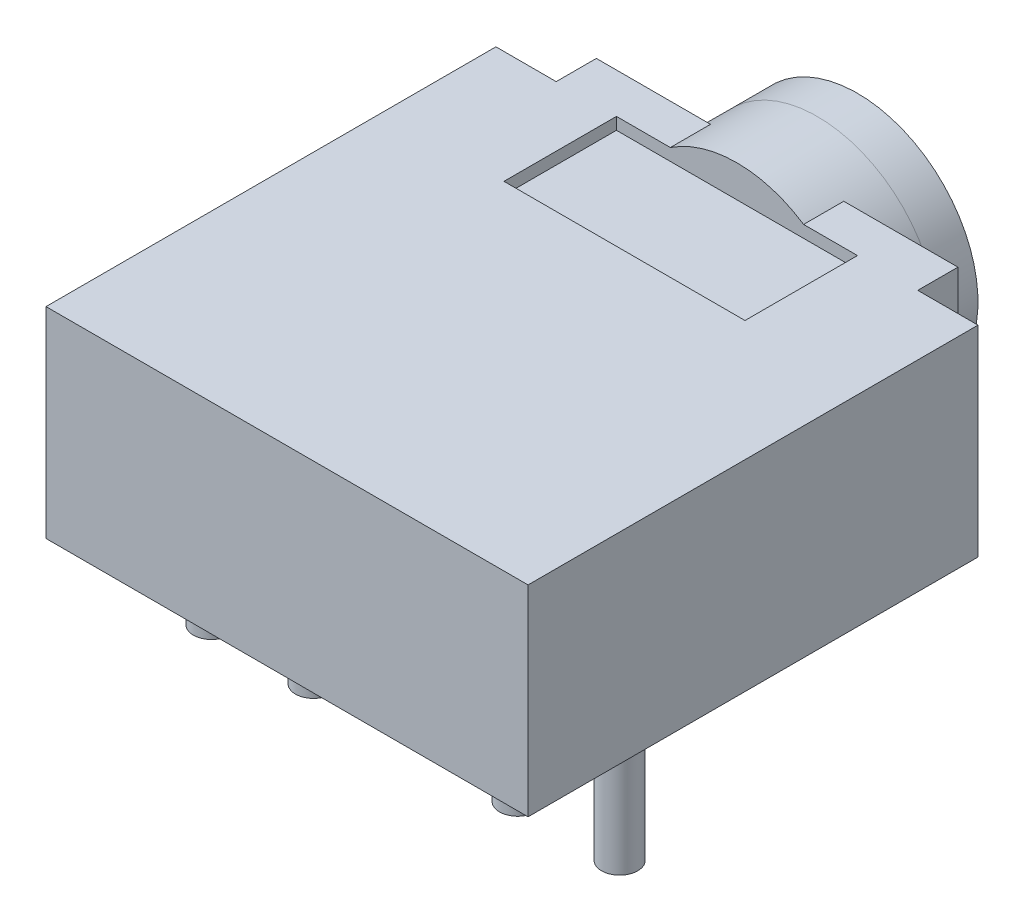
ISO-10303-21;
HEADER;
FILE_DESCRIPTION(('STEP AP214'),'2;1');
FILE_NAME('part.step','',(''),(''),'','','');
FILE_SCHEMA(('AUTOMOTIVE_DESIGN { 1 0 10303 214 1 1 1 1 }'));
ENDSEC;
DATA;
#1=APPLICATION_CONTEXT('core data for automotive mechanical design processes');
#2=APPLICATION_PROTOCOL_DEFINITION('international standard','automotive_design',2000,#1);
#3=PRODUCT_CONTEXT('',#1,'mechanical');
#4=PRODUCT('Part','Part','',(#3));
#5=PRODUCT_RELATED_PRODUCT_CATEGORY('part','',(#4));
#6=PRODUCT_DEFINITION_FORMATION('','',#4);
#7=PRODUCT_DEFINITION_CONTEXT('part definition',#1,'design');
#8=PRODUCT_DEFINITION('design','',#6,#7);
#9=PRODUCT_DEFINITION_SHAPE('','',#8);
#10=(LENGTH_UNIT() NAMED_UNIT(*) SI_UNIT(.MILLI.,.METRE.));
#11=(NAMED_UNIT(*) PLANE_ANGLE_UNIT() SI_UNIT($,.RADIAN.));
#12=(NAMED_UNIT(*) SI_UNIT($,.STERADIAN.) SOLID_ANGLE_UNIT());
#13=UNCERTAINTY_MEASURE_WITH_UNIT(LENGTH_MEASURE(1.E-05),#10,'distance_accuracy_value','');
#14=(GEOMETRIC_REPRESENTATION_CONTEXT(3) GLOBAL_UNCERTAINTY_ASSIGNED_CONTEXT((#13)) GLOBAL_UNIT_ASSIGNED_CONTEXT((#10,
#11,#12)) REPRESENTATION_CONTEXT('',''));
#15=CARTESIAN_POINT('',(0.,0.,0.));
#16=DIRECTION('',(0.,0.,1.));
#17=DIRECTION('',(1.,0.,0.));
#18=AXIS2_PLACEMENT_3D('',#15,#16,#17);
#19=CARTESIAN_POINT('',(-4.5,0.,-11.2));
#20=DIRECTION('',(0.,-1.,0.));
#21=DIRECTION('',(0.,0.,-1.));
#22=AXIS2_PLACEMENT_3D('',#19,#20,#21);
#23=PLANE('',#22);
#24=CARTESIAN_POINT('',(5.08,0.,-3.2));
#25=DIRECTION('',(0.,-1.,0.));
#26=DIRECTION('',(0.,0.,1.));
#27=AXIS2_PLACEMENT_3D('',#24,#25,#26);
#28=CIRCLE('',#27,0.45);
#29=CARTESIAN_POINT('',(5.08,0.,-2.75));
#30=VERTEX_POINT('',#29);
#31=EDGE_CURVE('E644',#30,#30,#28,.T.);
#32=ORIENTED_EDGE('',*,*,#31,.F.);
#33=EDGE_LOOP('',(#32));
#34=FACE_BOUND('',#33,.T.);
#35=CARTESIAN_POINT('',(-2.54,0.,-3.2));
#36=DIRECTION('',(0.,-1.,0.));
#37=DIRECTION('',(0.,0.,-1.));
#38=AXIS2_PLACEMENT_3D('',#35,#36,#37);
#39=CIRCLE('',#38,0.45);
#40=CARTESIAN_POINT('',(-2.54,0.,-3.65));
#41=VERTEX_POINT('',#40);
#42=EDGE_CURVE('E659',#41,#41,#39,.T.);
#43=ORIENTED_EDGE('',*,*,#42,.F.);
#44=EDGE_LOOP('',(#43));
#45=FACE_BOUND('',#44,.T.);
#46=DIRECTION('',(1.,0.,0.));
#47=VECTOR('',#46,1.);
#48=CARTESIAN_POINT('',(-4.5,0.,-11.2));
#49=LINE('',#48,#47);
#50=CARTESIAN_POINT('',(-1.6583123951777,0.,-11.2));
#51=VERTEX_POINT('',#50);
#52=CARTESIAN_POINT('',(1.6583123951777,0.,-11.2));
#53=VERTEX_POINT('',#52);
#54=EDGE_CURVE('E256',#51,#53,#49,.T.);
#55=ORIENTED_EDGE('',*,*,#54,.T.);
#56=DIRECTION('',(0.,0.,1.));
#57=VECTOR('',#56,1.);
#58=CARTESIAN_POINT('',(1.6583123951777,0.,-13.2));
#59=LINE('',#58,#57);
#60=CARTESIAN_POINT('',(1.6583123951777,0.,-12.2));
#61=VERTEX_POINT('',#60);
#62=EDGE_CURVE('E164',#53,#61,#59,.F.);
#63=ORIENTED_EDGE('',*,*,#62,.T.);
#64=DIRECTION('',(-1.,0.,0.));
#65=VECTOR('',#64,1.);
#66=CARTESIAN_POINT('',(4.5,0.,-12.2));
#67=LINE('',#66,#65);
#68=CARTESIAN_POINT('',(4.5,0.,-12.2));
#69=VERTEX_POINT('',#68);
#70=EDGE_CURVE('E199',#69,#61,#67,.T.);
#71=ORIENTED_EDGE('',*,*,#70,.F.);
#72=DIRECTION('',(0.,0.,-1.));
#73=VECTOR('',#72,1.);
#74=CARTESIAN_POINT('',(4.5,0.,-12.2));
#75=LINE('',#74,#73);
#76=CARTESIAN_POINT('',(4.5,0.,-11.2));
#77=VERTEX_POINT('',#76);
#78=EDGE_CURVE('E228',#77,#69,#75,.T.);
#79=ORIENTED_EDGE('',*,*,#78,.F.);
#80=DIRECTION('',(-1.,0.,0.));
#81=VECTOR('',#80,1.);
#82=CARTESIAN_POINT('',(4.5,0.,-11.2));
#83=LINE('',#82,#81);
#84=CARTESIAN_POINT('',(6.,0.,-11.2));
#85=VERTEX_POINT('',#84);
#86=EDGE_CURVE('E226',#85,#77,#83,.T.);
#87=ORIENTED_EDGE('',*,*,#86,.F.);
#88=DIRECTION('',(0.,0.,-1.));
#89=VECTOR('',#88,1.);
#90=CARTESIAN_POINT('',(6.,0.,-11.2));
#91=LINE('',#90,#89);
#92=CARTESIAN_POINT('',(6.,0.,0.));
#93=VERTEX_POINT('',#92);
#94=EDGE_CURVE('E224',#93,#85,#91,.T.);
#95=ORIENTED_EDGE('',*,*,#94,.F.);
#96=DIRECTION('',(1.,0.,0.));
#97=VECTOR('',#96,1.);
#98=CARTESIAN_POINT('',(-6.,0.,0.));
#99=LINE('',#98,#97);
#100=CARTESIAN_POINT('',(-6.,0.,0.));
#101=VERTEX_POINT('',#100);
#102=EDGE_CURVE('E222',#101,#93,#99,.T.);
#103=ORIENTED_EDGE('',*,*,#102,.F.);
#104=DIRECTION('',(0.,0.,1.));
#105=VECTOR('',#104,1.);
#106=CARTESIAN_POINT('',(-6.,0.,-11.2));
#107=LINE('',#106,#105);
#108=CARTESIAN_POINT('',(-6.,0.,-11.2));
#109=VERTEX_POINT('',#108);
#110=EDGE_CURVE('E220',#109,#101,#107,.T.);
#111=ORIENTED_EDGE('',*,*,#110,.F.);
#112=DIRECTION('',(-1.,0.,0.));
#113=VECTOR('',#112,1.);
#114=CARTESIAN_POINT('',(-4.5,0.,-11.2));
#115=LINE('',#114,#113);
#116=CARTESIAN_POINT('',(-4.5,0.,-11.2));
#117=VERTEX_POINT('',#116);
#118=EDGE_CURVE('E218',#117,#109,#115,.T.);
#119=ORIENTED_EDGE('',*,*,#118,.F.);
#120=DIRECTION('',(0.,0.,1.));
#121=VECTOR('',#120,1.);
#122=CARTESIAN_POINT('',(-4.5,0.,-12.2));
#123=LINE('',#122,#121);
#124=CARTESIAN_POINT('',(-4.5,0.,-12.2));
#125=VERTEX_POINT('',#124);
#126=EDGE_CURVE('E187',#125,#117,#123,.T.);
#127=ORIENTED_EDGE('',*,*,#126,.F.);
#128=CARTESIAN_POINT('',(-1.6583123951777,0.,-12.2));
#129=VERTEX_POINT('',#128);
#130=EDGE_CURVE('E230',#129,#125,#67,.T.);
#131=ORIENTED_EDGE('',*,*,#130,.F.);
#132=DIRECTION('',(0.,0.,1.));
#133=VECTOR('',#132,1.);
#134=CARTESIAN_POINT('',(-1.6583123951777,0.,-13.2));
#135=LINE('',#134,#133);
#136=EDGE_CURVE('E258',#129,#51,#135,.T.);
#137=ORIENTED_EDGE('',*,*,#136,.T.);
#138=EDGE_LOOP('',(#55,#63,#71,#79,#87,#95,#103,#111,#119,#127,#131,#137));
#139=FACE_BOUND('',#138,.T.);
#140=CARTESIAN_POINT('',(-5.08,0.,-3.2));
#141=DIRECTION('',(0.,-1.,0.));
#142=DIRECTION('',(0.,0.,-1.));
#143=AXIS2_PLACEMENT_3D('',#140,#141,#142);
#144=CIRCLE('',#143,0.45);
#145=CARTESIAN_POINT('',(-5.08,0.,-3.65));
#146=VERTEX_POINT('',#145);
#147=EDGE_CURVE('E665',#146,#146,#144,.T.);
#148=ORIENTED_EDGE('',*,*,#147,.F.);
#149=EDGE_LOOP('',(#148));
#150=FACE_BOUND('',#149,.T.);
#151=CARTESIAN_POINT('',(0.,0.,-8.39));
#152=DIRECTION('',(0.,-1.,0.));
#153=DIRECTION('',(0.,0.,-1.));
#154=AXIS2_PLACEMENT_3D('',#151,#152,#153);
#155=CIRCLE('',#154,0.450000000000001);
#156=CARTESIAN_POINT('',(0.,0.,-8.84));
#157=VERTEX_POINT('',#156);
#158=EDGE_CURVE('E654',#157,#157,#155,.T.);
#159=ORIENTED_EDGE('',*,*,#158,.F.);
#160=EDGE_LOOP('',(#159));
#161=FACE_BOUND('',#160,.T.);
#162=CARTESIAN_POINT('',(2.54,0.,-3.2));
#163=DIRECTION('',(0.,-1.,0.));
#164=DIRECTION('',(0.,0.,1.));
#165=AXIS2_PLACEMENT_3D('',#162,#163,#164);
#166=CIRCLE('',#165,0.45);
#167=CARTESIAN_POINT('',(2.54,0.,-2.75));
#168=VERTEX_POINT('',#167);
#169=EDGE_CURVE('E645',#168,#168,#166,.T.);
#170=ORIENTED_EDGE('',*,*,#169,.F.);
#171=EDGE_LOOP('',(#170));
#172=FACE_BOUND('',#171,.T.);
#173=ADVANCED_FACE('F37',(#34,#45,#139,#150,#161,#172),#23,.T.);
#174=CARTESIAN_POINT('',(4.5,5.,-12.2));
#175=DIRECTION('',(0.,0.,1.));
#176=DIRECTION('',(1.,0.,0.));
#177=AXIS2_PLACEMENT_3D('',#174,#175,#176);
#178=PLANE('',#177);
#179=CARTESIAN_POINT('',(0.,2.5,-12.2));
#180=DIRECTION('',(0.,0.,1.));
#181=DIRECTION('',(1.,0.,0.));
#182=AXIS2_PLACEMENT_3D('',#179,#180,#181);
#183=CIRCLE('',#182,3.);
#184=CARTESIAN_POINT('',(-1.6583123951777,5.,-12.2));
#185=VERTEX_POINT('',#184);
#186=EDGE_CURVE('E160',#129,#185,#183,.F.);
#187=ORIENTED_EDGE('',*,*,#186,.F.);
#188=ORIENTED_EDGE('',*,*,#130,.T.);
#189=DIRECTION('',(0.,-1.,0.));
#190=VECTOR('',#189,1.);
#191=CARTESIAN_POINT('',(-4.5,5.,-12.2));
#192=LINE('',#191,#190);
#193=CARTESIAN_POINT('',(-4.5,5.,-12.2));
#194=VERTEX_POINT('',#193);
#195=EDGE_CURVE('E215',#194,#125,#192,.T.);
#196=ORIENTED_EDGE('',*,*,#195,.F.);
#197=DIRECTION('',(-1.,0.,0.));
#198=VECTOR('',#197,1.);
#199=CARTESIAN_POINT('',(4.5,5.,-12.2));
#200=LINE('',#199,#198);
#201=EDGE_CURVE('E211',#185,#194,#200,.T.);
#202=ORIENTED_EDGE('',*,*,#201,.F.);
#203=EDGE_LOOP('',(#187,#188,#196,#202));
#204=FACE_BOUND('',#203,.T.);
#205=ADVANCED_FACE('F307',(#204),#178,.F.);
#206=CARTESIAN_POINT('',(1.6583123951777,5.,-12.2));
#207=VERTEX_POINT('',#206);
#208=EDGE_CURVE('E266',#207,#61,#183,.F.);
#209=ORIENTED_EDGE('',*,*,#208,.F.);
#210=CARTESIAN_POINT('',(4.5,5.,-12.2));
#211=VERTEX_POINT('',#210);
#212=EDGE_CURVE('E212',#211,#207,#200,.T.);
#213=ORIENTED_EDGE('',*,*,#212,.F.);
#214=DIRECTION('',(0.,-1.,0.));
#215=VECTOR('',#214,1.);
#216=CARTESIAN_POINT('',(4.5,5.,-12.2));
#217=LINE('',#216,#215);
#218=EDGE_CURVE('E235',#211,#69,#217,.T.);
#219=ORIENTED_EDGE('',*,*,#218,.T.);
#220=ORIENTED_EDGE('',*,*,#70,.T.);
#221=EDGE_LOOP('',(#209,#213,#219,#220));
#222=FACE_BOUND('',#221,.T.);
#223=ADVANCED_FACE('F313',(#222),#178,.F.);
#224=CARTESIAN_POINT('',(-4.5,5.,-11.2));
#225=DIRECTION('',(0.,-1.,0.));
#226=DIRECTION('',(0.,0.,-1.));
#227=AXIS2_PLACEMENT_3D('',#224,#225,#226);
#228=PLANE('',#227);
#229=DIRECTION('',(0.,0.,1.));
#230=VECTOR('',#229,1.);
#231=CARTESIAN_POINT('',(1.6583123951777,5.,-13.2));
#232=LINE('',#231,#230);
#233=CARTESIAN_POINT('',(1.6583123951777,5.,-11.2));
#234=VERTEX_POINT('',#233);
#235=EDGE_CURVE('E269',#234,#207,#232,.F.);
#236=ORIENTED_EDGE('',*,*,#235,.F.);
#237=DIRECTION('',(-1.,0.,0.));
#238=VECTOR('',#237,1.);
#239=CARTESIAN_POINT('',(-3.,5.,-11.2));
#240=LINE('',#239,#238);
#241=CARTESIAN_POINT('',(3.,5.,-11.2));
#242=VERTEX_POINT('',#241);
#243=EDGE_CURVE('E172',#242,#234,#240,.T.);
#244=ORIENTED_EDGE('',*,*,#243,.F.);
#245=DIRECTION('',(0.,0.,-1.));
#246=VECTOR('',#245,1.);
#247=CARTESIAN_POINT('',(3.,5.,-11.2));
#248=LINE('',#247,#246);
#249=CARTESIAN_POINT('',(3.,5.,-8.4));
#250=VERTEX_POINT('',#249);
#251=EDGE_CURVE('E177',#250,#242,#248,.T.);
#252=ORIENTED_EDGE('',*,*,#251,.F.);
#253=DIRECTION('',(1.,0.,0.));
#254=VECTOR('',#253,1.);
#255=CARTESIAN_POINT('',(-3.,5.,-8.4));
#256=LINE('',#255,#254);
#257=CARTESIAN_POINT('',(-3.,5.,-8.4));
#258=VERTEX_POINT('',#257);
#259=EDGE_CURVE('E181',#258,#250,#256,.T.);
#260=ORIENTED_EDGE('',*,*,#259,.F.);
#261=DIRECTION('',(0.,0.,1.));
#262=VECTOR('',#261,1.);
#263=CARTESIAN_POINT('',(-3.,5.,-11.2));
#264=LINE('',#263,#262);
#265=CARTESIAN_POINT('',(-3.,5.,-11.2));
#266=VERTEX_POINT('',#265);
#267=EDGE_CURVE('E63',#266,#258,#264,.T.);
#268=ORIENTED_EDGE('',*,*,#267,.F.);
#269=CARTESIAN_POINT('',(-1.6583123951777,5.,-11.2));
#270=VERTEX_POINT('',#269);
#271=EDGE_CURVE('E170',#270,#266,#240,.T.);
#272=ORIENTED_EDGE('',*,*,#271,.F.);
#273=DIRECTION('',(0.,0.,1.));
#274=VECTOR('',#273,1.);
#275=CARTESIAN_POINT('',(-1.6583123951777,5.,-13.2));
#276=LINE('',#275,#274);
#277=EDGE_CURVE('E154',#185,#270,#276,.T.);
#278=ORIENTED_EDGE('',*,*,#277,.F.);
#279=ORIENTED_EDGE('',*,*,#201,.T.);
#280=DIRECTION('',(0.,0.,1.));
#281=VECTOR('',#280,1.);
#282=CARTESIAN_POINT('',(-4.5,5.,-12.2));
#283=LINE('',#282,#281);
#284=CARTESIAN_POINT('',(-4.5,5.,-11.2));
#285=VERTEX_POINT('',#284);
#286=EDGE_CURVE('E195',#194,#285,#283,.T.);
#287=ORIENTED_EDGE('',*,*,#286,.T.);
#288=DIRECTION('',(-1.,0.,0.));
#289=VECTOR('',#288,1.);
#290=CARTESIAN_POINT('',(-4.5,5.,-11.2));
#291=LINE('',#290,#289);
#292=CARTESIAN_POINT('',(-6.,5.,-11.2));
#293=VERTEX_POINT('',#292);
#294=EDGE_CURVE('E198',#285,#293,#291,.T.);
#295=ORIENTED_EDGE('',*,*,#294,.T.);
#296=DIRECTION('',(0.,0.,1.));
#297=VECTOR('',#296,1.);
#298=CARTESIAN_POINT('',(-6.,5.,-11.2));
#299=LINE('',#298,#297);
#300=CARTESIAN_POINT('',(-6.,5.,0.));
#301=VERTEX_POINT('',#300);
#302=EDGE_CURVE('E201',#293,#301,#299,.T.);
#303=ORIENTED_EDGE('',*,*,#302,.T.);
#304=DIRECTION('',(1.,0.,0.));
#305=VECTOR('',#304,1.);
#306=CARTESIAN_POINT('',(-6.,5.,0.));
#307=LINE('',#306,#305);
#308=CARTESIAN_POINT('',(6.,5.,0.));
#309=VERTEX_POINT('',#308);
#310=EDGE_CURVE('E203',#301,#309,#307,.T.);
#311=ORIENTED_EDGE('',*,*,#310,.T.);
#312=DIRECTION('',(0.,0.,-1.));
#313=VECTOR('',#312,1.);
#314=CARTESIAN_POINT('',(6.,5.,-11.2));
#315=LINE('',#314,#313);
#316=CARTESIAN_POINT('',(6.,5.,-11.2));
#317=VERTEX_POINT('',#316);
#318=EDGE_CURVE('E205',#309,#317,#315,.T.);
#319=ORIENTED_EDGE('',*,*,#318,.T.);
#320=DIRECTION('',(-1.,0.,0.));
#321=VECTOR('',#320,1.);
#322=CARTESIAN_POINT('',(4.5,5.,-11.2));
#323=LINE('',#322,#321);
#324=CARTESIAN_POINT('',(4.5,5.,-11.2));
#325=VERTEX_POINT('',#324);
#326=EDGE_CURVE('E207',#317,#325,#323,.T.);
#327=ORIENTED_EDGE('',*,*,#326,.T.);
#328=DIRECTION('',(0.,0.,-1.));
#329=VECTOR('',#328,1.);
#330=CARTESIAN_POINT('',(4.5,5.,-12.2));
#331=LINE('',#330,#329);
#332=EDGE_CURVE('E209',#325,#211,#331,.T.);
#333=ORIENTED_EDGE('',*,*,#332,.T.);
#334=ORIENTED_EDGE('',*,*,#212,.T.);
#335=EDGE_LOOP('',(#236,#244,#252,#260,#268,#272,#278,#279,#287,#295,#303,#311,#319,#327,#333,#334));
#336=FACE_BOUND('',#335,.T.);
#337=ADVANCED_FACE('F175',(#336),#228,.F.);
#338=CARTESIAN_POINT('',(-4.5,5.,-12.2));
#339=DIRECTION('',(1.,0.,0.));
#340=DIRECTION('',(0.,0.,-1.));
#341=AXIS2_PLACEMENT_3D('',#338,#339,#340);
#342=PLANE('',#341);
#343=ORIENTED_EDGE('',*,*,#126,.T.);
#344=DIRECTION('',(0.,-1.,0.));
#345=VECTOR('',#344,1.);
#346=CARTESIAN_POINT('',(-4.5,5.,-11.2));
#347=LINE('',#346,#345);
#348=EDGE_CURVE('E11',#285,#117,#347,.T.);
#349=ORIENTED_EDGE('',*,*,#348,.F.);
#350=ORIENTED_EDGE('',*,*,#286,.F.);
#351=ORIENTED_EDGE('',*,*,#195,.T.);
#352=EDGE_LOOP('',(#343,#349,#350,#351));
#353=FACE_BOUND('',#352,.T.);
#354=ADVANCED_FACE('F39',(#353),#342,.F.);
#355=CARTESIAN_POINT('',(-4.5,5.,-11.2));
#356=DIRECTION('',(0.,0.,1.));
#357=DIRECTION('',(1.,0.,0.));
#358=AXIS2_PLACEMENT_3D('',#355,#356,#357);
#359=PLANE('',#358);
#360=ORIENTED_EDGE('',*,*,#118,.T.);
#361=DIRECTION('',(0.,-1.,0.));
#362=VECTOR('',#361,1.);
#363=CARTESIAN_POINT('',(-6.,5.,-11.2));
#364=LINE('',#363,#362);
#365=EDGE_CURVE('E48',#293,#109,#364,.T.);
#366=ORIENTED_EDGE('',*,*,#365,.F.);
#367=ORIENTED_EDGE('',*,*,#294,.F.);
#368=ORIENTED_EDGE('',*,*,#348,.T.);
#369=EDGE_LOOP('',(#360,#366,#367,#368));
#370=FACE_BOUND('',#369,.T.);
#371=ADVANCED_FACE('F332',(#370),#359,.F.);
#372=CARTESIAN_POINT('',(-6.,5.,-11.2));
#373=DIRECTION('',(1.,0.,0.));
#374=DIRECTION('',(0.,0.,-1.));
#375=AXIS2_PLACEMENT_3D('',#372,#373,#374);
#376=PLANE('',#375);
#377=ORIENTED_EDGE('',*,*,#110,.T.);
#378=DIRECTION('',(0.,-1.,0.));
#379=VECTOR('',#378,1.);
#380=CARTESIAN_POINT('',(-6.,5.,0.));
#381=LINE('',#380,#379);
#382=EDGE_CURVE('E247',#301,#101,#381,.T.);
#383=ORIENTED_EDGE('',*,*,#382,.F.);
#384=ORIENTED_EDGE('',*,*,#302,.F.);
#385=ORIENTED_EDGE('',*,*,#365,.T.);
#386=EDGE_LOOP('',(#377,#383,#384,#385));
#387=FACE_BOUND('',#386,.T.);
#388=ADVANCED_FACE('F329',(#387),#376,.F.);
#389=CARTESIAN_POINT('',(-6.,5.,0.));
#390=DIRECTION('',(0.,0.,-1.));
#391=DIRECTION('',(-1.,0.,0.));
#392=AXIS2_PLACEMENT_3D('',#389,#390,#391);
#393=PLANE('',#392);
#394=ORIENTED_EDGE('',*,*,#102,.T.);
#395=DIRECTION('',(0.,-1.,0.));
#396=VECTOR('',#395,1.);
#397=CARTESIAN_POINT('',(6.,5.,0.));
#398=LINE('',#397,#396);
#399=EDGE_CURVE('E244',#309,#93,#398,.T.);
#400=ORIENTED_EDGE('',*,*,#399,.F.);
#401=ORIENTED_EDGE('',*,*,#310,.F.);
#402=ORIENTED_EDGE('',*,*,#382,.T.);
#403=EDGE_LOOP('',(#394,#400,#401,#402));
#404=FACE_BOUND('',#403,.T.);
#405=ADVANCED_FACE('F325',(#404),#393,.F.);
#406=CARTESIAN_POINT('',(6.,5.,-11.2));
#407=DIRECTION('',(-1.,0.,0.));
#408=DIRECTION('',(0.,0.,1.));
#409=AXIS2_PLACEMENT_3D('',#406,#407,#408);
#410=PLANE('',#409);
#411=ORIENTED_EDGE('',*,*,#94,.T.);
#412=DIRECTION('',(0.,-1.,0.));
#413=VECTOR('',#412,1.);
#414=CARTESIAN_POINT('',(6.,5.,-11.2));
#415=LINE('',#414,#413);
#416=EDGE_CURVE('E241',#317,#85,#415,.T.);
#417=ORIENTED_EDGE('',*,*,#416,.F.);
#418=ORIENTED_EDGE('',*,*,#318,.F.);
#419=ORIENTED_EDGE('',*,*,#399,.T.);
#420=EDGE_LOOP('',(#411,#417,#418,#419));
#421=FACE_BOUND('',#420,.T.);
#422=ADVANCED_FACE('F321',(#421),#410,.F.);
#423=CARTESIAN_POINT('',(4.5,5.,-11.2));
#424=DIRECTION('',(0.,0.,1.));
#425=DIRECTION('',(1.,0.,0.));
#426=AXIS2_PLACEMENT_3D('',#423,#424,#425);
#427=PLANE('',#426);
#428=ORIENTED_EDGE('',*,*,#86,.T.);
#429=DIRECTION('',(0.,-1.,0.));
#430=VECTOR('',#429,1.);
#431=CARTESIAN_POINT('',(4.5,5.,-11.2));
#432=LINE('',#431,#430);
#433=EDGE_CURVE('E238',#325,#77,#432,.T.);
#434=ORIENTED_EDGE('',*,*,#433,.F.);
#435=ORIENTED_EDGE('',*,*,#326,.F.);
#436=ORIENTED_EDGE('',*,*,#416,.T.);
#437=EDGE_LOOP('',(#428,#434,#435,#436));
#438=FACE_BOUND('',#437,.T.);
#439=ADVANCED_FACE('F301',(#438),#427,.F.);
#440=CARTESIAN_POINT('',(4.5,5.,-12.2));
#441=DIRECTION('',(-1.,0.,0.));
#442=DIRECTION('',(0.,0.,1.));
#443=AXIS2_PLACEMENT_3D('',#440,#441,#442);
#444=PLANE('',#443);
#445=ORIENTED_EDGE('',*,*,#78,.T.);
#446=ORIENTED_EDGE('',*,*,#218,.F.);
#447=ORIENTED_EDGE('',*,*,#332,.F.);
#448=ORIENTED_EDGE('',*,*,#433,.T.);
#449=EDGE_LOOP('',(#445,#446,#447,#448));
#450=FACE_BOUND('',#449,.T.);
#451=ADVANCED_FACE('F294',(#450),#444,.F.);
#452=CARTESIAN_POINT('',(-3.,4.7,-11.2));
#453=DIRECTION('',(-1.,0.,0.));
#454=DIRECTION('',(0.,0.,1.));
#455=AXIS2_PLACEMENT_3D('',#452,#453,#454);
#456=PLANE('',#455);
#457=ORIENTED_EDGE('',*,*,#267,.T.);
#458=DIRECTION('',(0.,1.,0.));
#459=VECTOR('',#458,1.);
#460=CARTESIAN_POINT('',(-3.,4.7,-8.4));
#461=LINE('',#460,#459);
#462=CARTESIAN_POINT('',(-3.,4.7,-8.4));
#463=VERTEX_POINT('',#462);
#464=EDGE_CURVE('E192',#463,#258,#461,.T.);
#465=ORIENTED_EDGE('',*,*,#464,.F.);
#466=DIRECTION('',(0.,0.,1.));
#467=VECTOR('',#466,1.);
#468=CARTESIAN_POINT('',(-3.,4.7,-11.2));
#469=LINE('',#468,#467);
#470=CARTESIAN_POINT('',(-3.,4.7,-11.2));
#471=VERTEX_POINT('',#470);
#472=EDGE_CURVE('E179',#471,#463,#469,.T.);
#473=ORIENTED_EDGE('',*,*,#472,.F.);
#474=DIRECTION('',(0.,1.,0.));
#475=VECTOR('',#474,1.);
#476=CARTESIAN_POINT('',(-3.,4.7,-11.2));
#477=LINE('',#476,#475);
#478=EDGE_CURVE('E185',#471,#266,#477,.T.);
#479=ORIENTED_EDGE('',*,*,#478,.T.);
#480=EDGE_LOOP('',(#457,#465,#473,#479));
#481=FACE_BOUND('',#480,.T.);
#482=ADVANCED_FACE('F292',(#481),#456,.F.);
#483=CARTESIAN_POINT('',(-3.,4.7,-11.2));
#484=DIRECTION('',(0.,0.,-1.));
#485=DIRECTION('',(-1.,0.,0.));
#486=AXIS2_PLACEMENT_3D('',#483,#484,#485);
#487=PLANE('',#486);
#488=ORIENTED_EDGE('',*,*,#478,.F.);
#489=DIRECTION('',(-1.,0.,0.));
#490=VECTOR('',#489,1.);
#491=CARTESIAN_POINT('',(-3.,4.7,-11.2));
#492=LINE('',#491,#490);
#493=CARTESIAN_POINT('',(3.,4.7,-11.2));
#494=VERTEX_POINT('',#493);
#495=EDGE_CURVE('E194',#494,#471,#492,.T.);
#496=ORIENTED_EDGE('',*,*,#495,.F.);
#497=DIRECTION('',(0.,1.,0.));
#498=VECTOR('',#497,1.);
#499=CARTESIAN_POINT('',(3.,4.7,-11.2));
#500=LINE('',#499,#498);
#501=EDGE_CURVE('E188',#494,#242,#500,.T.);
#502=ORIENTED_EDGE('',*,*,#501,.T.);
#503=ORIENTED_EDGE('',*,*,#243,.T.);
#504=CARTESIAN_POINT('',(0.,2.5,-11.2));
#505=DIRECTION('',(0.,0.,-1.));
#506=DIRECTION('',(-1.,0.,0.));
#507=AXIS2_PLACEMENT_3D('',#504,#505,#506);
#508=CIRCLE('',#507,3.);
#509=EDGE_CURVE('E157',#270,#234,#508,.T.);
#510=ORIENTED_EDGE('',*,*,#509,.F.);
#511=ORIENTED_EDGE('',*,*,#271,.T.);
#512=EDGE_LOOP('',(#488,#496,#502,#503,#510,#511));
#513=FACE_BOUND('',#512,.T.);
#514=ADVANCED_FACE('F169',(#513),#487,.F.);
#515=CARTESIAN_POINT('',(3.,4.7,-11.2));
#516=DIRECTION('',(1.,0.,0.));
#517=DIRECTION('',(0.,0.,-1.));
#518=AXIS2_PLACEMENT_3D('',#515,#516,#517);
#519=PLANE('',#518);
#520=ORIENTED_EDGE('',*,*,#251,.T.);
#521=ORIENTED_EDGE('',*,*,#501,.F.);
#522=DIRECTION('',(0.,0.,-1.));
#523=VECTOR('',#522,1.);
#524=CARTESIAN_POINT('',(3.,4.7,-11.2));
#525=LINE('',#524,#523);
#526=CARTESIAN_POINT('',(3.,4.7,-8.4));
#527=VERTEX_POINT('',#526);
#528=EDGE_CURVE('E276',#527,#494,#525,.T.);
#529=ORIENTED_EDGE('',*,*,#528,.F.);
#530=DIRECTION('',(0.,1.,0.));
#531=VECTOR('',#530,1.);
#532=CARTESIAN_POINT('',(3.,4.7,-8.4));
#533=LINE('',#532,#531);
#534=EDGE_CURVE('E190',#527,#250,#533,.T.);
#535=ORIENTED_EDGE('',*,*,#534,.T.);
#536=EDGE_LOOP('',(#520,#521,#529,#535));
#537=FACE_BOUND('',#536,.T.);
#538=ADVANCED_FACE('F287',(#537),#519,.F.);
#539=CARTESIAN_POINT('',(-3.,4.7,-8.4));
#540=DIRECTION('',(0.,0.,1.));
#541=DIRECTION('',(1.,0.,0.));
#542=AXIS2_PLACEMENT_3D('',#539,#540,#541);
#543=PLANE('',#542);
#544=ORIENTED_EDGE('',*,*,#259,.T.);
#545=ORIENTED_EDGE('',*,*,#534,.F.);
#546=DIRECTION('',(1.,0.,0.));
#547=VECTOR('',#546,1.);
#548=CARTESIAN_POINT('',(-3.,4.7,-8.4));
#549=LINE('',#548,#547);
#550=EDGE_CURVE('E273',#463,#527,#549,.T.);
#551=ORIENTED_EDGE('',*,*,#550,.F.);
#552=ORIENTED_EDGE('',*,*,#464,.T.);
#553=EDGE_LOOP('',(#544,#545,#551,#552));
#554=FACE_BOUND('',#553,.T.);
#555=ADVANCED_FACE('F283',(#554),#543,.F.);
#556=CARTESIAN_POINT('',(-3.,4.7,-8.4));
#557=DIRECTION('',(0.,1.,0.));
#558=DIRECTION('',(0.,0.,1.));
#559=AXIS2_PLACEMENT_3D('',#556,#557,#558);
#560=PLANE('',#559);
#561=ORIENTED_EDGE('',*,*,#472,.T.);
#562=ORIENTED_EDGE('',*,*,#550,.T.);
#563=ORIENTED_EDGE('',*,*,#528,.T.);
#564=ORIENTED_EDGE('',*,*,#495,.T.);
#565=EDGE_LOOP('',(#561,#562,#563,#564));
#566=FACE_BOUND('',#565,.T.);
#567=ADVANCED_FACE('F290',(#566),#560,.T.);
#568=CARTESIAN_POINT('',(0.,2.5,-13.2));
#569=DIRECTION('',(0.,0.,1.));
#570=DIRECTION('',(1.,0.,0.));
#571=AXIS2_PLACEMENT_3D('',#568,#569,#570);
#572=CYLINDRICAL_SURFACE('',#571,3.);
#573=CARTESIAN_POINT('',(0.,2.5,-13.2));
#574=DIRECTION('',(0.,0.,-1.));
#575=DIRECTION('',(-1.,0.,0.));
#576=AXIS2_PLACEMENT_3D('',#573,#574,#575);
#577=CIRCLE('',#576,2.999);
#578=CARTESIAN_POINT('',(-2.999,2.5,-13.2));
#579=VERTEX_POINT('',#578);
#580=EDGE_CURVE('E173',#579,#579,#577,.T.);
#581=ORIENTED_EDGE('',*,*,#580,.F.);
#582=EDGE_LOOP('',(#581));
#583=FACE_BOUND('',#582,.T.);
#584=ORIENTED_EDGE('',*,*,#509,.T.);
#585=ORIENTED_EDGE('',*,*,#235,.T.);
#586=ORIENTED_EDGE('',*,*,#208,.T.);
#587=ORIENTED_EDGE('',*,*,#62,.F.);
#588=EDGE_CURVE('E55',#53,#51,#508,.T.);
#589=ORIENTED_EDGE('',*,*,#588,.T.);
#590=ORIENTED_EDGE('',*,*,#136,.F.);
#591=ORIENTED_EDGE('',*,*,#186,.T.);
#592=ORIENTED_EDGE('',*,*,#277,.T.);
#593=EDGE_LOOP('',(#584,#585,#586,#587,#589,#590,#591,#592));
#594=FACE_BOUND('',#593,.T.);
#595=ADVANCED_FACE('F156',(#583,#594),#572,.T.);
#596=CARTESIAN_POINT('',(0.,2.5,-11.2));
#597=DIRECTION('',(0.,0.,-1.));
#598=DIRECTION('',(-1.,0.,0.));
#599=AXIS2_PLACEMENT_3D('',#596,#597,#598);
#600=PLANE('',#599);
#601=ORIENTED_EDGE('',*,*,#54,.F.);
#602=ORIENTED_EDGE('',*,*,#588,.F.);
#603=EDGE_LOOP('',(#601,#602));
#604=FACE_BOUND('',#603,.T.);
#605=ADVANCED_FACE('F383',(#604),#600,.F.);
#606=CARTESIAN_POINT('',(0.,2.5,-14.2));
#607=DIRECTION('',(0.,0.,1.));
#608=DIRECTION('',(1.,0.,0.));
#609=AXIS2_PLACEMENT_3D('',#606,#607,#608);
#610=CYLINDRICAL_SURFACE('',#609,2.999);
#611=CARTESIAN_POINT('',(0.,2.5,-14.2));
#612=DIRECTION('',(0.,0.,-1.));
#613=DIRECTION('',(-1.,0.,0.));
#614=AXIS2_PLACEMENT_3D('',#611,#612,#613);
#615=CIRCLE('',#614,2.999);
#616=CARTESIAN_POINT('',(-2.999,2.5,-14.2));
#617=VERTEX_POINT('',#616);
#618=EDGE_CURVE('E359',#617,#617,#615,.T.);
#619=ORIENTED_EDGE('',*,*,#618,.F.);
#620=EDGE_LOOP('',(#619));
#621=FACE_BOUND('',#620,.T.);
#622=ORIENTED_EDGE('',*,*,#580,.T.);
#623=EDGE_LOOP('',(#622));
#624=FACE_BOUND('',#623,.T.);
#625=ADVANCED_FACE('F372',(#621,#624),#610,.T.);
#626=CARTESIAN_POINT('',(0.,2.5,-14.2));
#627=DIRECTION('',(0.,0.,-1.));
#628=DIRECTION('',(-1.,0.,0.));
#629=AXIS2_PLACEMENT_3D('',#626,#627,#628);
#630=PLANE('',#629);
#631=CARTESIAN_POINT('',(0.,2.5,-14.2));
#632=DIRECTION('',(0.,0.,-1.));
#633=DIRECTION('',(-1.,0.,0.));
#634=AXIS2_PLACEMENT_3D('',#631,#632,#633);
#635=CIRCLE('',#634,1.75);
#636=CARTESIAN_POINT('',(-1.75,2.5,-14.2));
#637=VERTEX_POINT('',#636);
#638=EDGE_CURVE('E366',#637,#637,#635,.T.);
#639=ORIENTED_EDGE('',*,*,#638,.F.);
#640=EDGE_LOOP('',(#639));
#641=FACE_BOUND('',#640,.T.);
#642=ORIENTED_EDGE('',*,*,#618,.T.);
#643=EDGE_LOOP('',(#642));
#644=FACE_BOUND('',#643,.T.);
#645=ADVANCED_FACE('F382',(#641,#644),#630,.T.);
#646=CARTESIAN_POINT('',(0.,2.5,-4.2));
#647=DIRECTION('',(0.,0.,-1.));
#648=DIRECTION('',(-1.,0.,0.));
#649=AXIS2_PLACEMENT_3D('',#646,#647,#648);
#650=CYLINDRICAL_SURFACE('',#649,1.75);
#651=CARTESIAN_POINT('',(0.,2.5,-4.2));
#652=DIRECTION('',(0.,0.,-1.));
#653=DIRECTION('',(-1.,0.,0.));
#654=AXIS2_PLACEMENT_3D('',#651,#652,#653);
#655=CIRCLE('',#654,1.75);
#656=CARTESIAN_POINT('',(-1.75,2.5,-4.2));
#657=VERTEX_POINT('',#656);
#658=EDGE_CURVE('E361',#657,#657,#655,.T.);
#659=ORIENTED_EDGE('',*,*,#658,.F.);
#660=EDGE_LOOP('',(#659));
#661=FACE_BOUND('',#660,.T.);
#662=ORIENTED_EDGE('',*,*,#638,.T.);
#663=EDGE_LOOP('',(#662));
#664=FACE_BOUND('',#663,.T.);
#665=ADVANCED_FACE('F422',(#661,#664),#650,.F.);
#666=CARTESIAN_POINT('',(0.,2.5,-4.2));
#667=DIRECTION('',(0.,0.,-1.));
#668=DIRECTION('',(-1.,0.,0.));
#669=AXIS2_PLACEMENT_3D('',#666,#667,#668);
#670=PLANE('',#669);
#671=ORIENTED_EDGE('',*,*,#658,.T.);
#672=EDGE_LOOP('',(#671));
#673=FACE_BOUND('',#672,.T.);
#674=ADVANCED_FACE('F429',(#673),#670,.T.);
#675=CARTESIAN_POINT('',(-5.08,-3.,-3.2));
#676=DIRECTION('',(0.,1.,0.));
#677=DIRECTION('',(0.,0.,1.));
#678=AXIS2_PLACEMENT_3D('',#675,#676,#677);
#679=CYLINDRICAL_SURFACE('',#678,0.45);
#680=CARTESIAN_POINT('',(-5.08,-3.,-3.2));
#681=DIRECTION('',(0.,-1.,0.));
#682=DIRECTION('',(0.,0.,-1.));
#683=AXIS2_PLACEMENT_3D('',#680,#681,#682);
#684=CIRCLE('',#683,0.45);
#685=CARTESIAN_POINT('',(-5.08,-3.,-3.65));
#686=VERTEX_POINT('',#685);
#687=EDGE_CURVE('E668',#686,#686,#684,.T.);
#688=ORIENTED_EDGE('',*,*,#687,.F.);
#689=EDGE_LOOP('',(#688));
#690=FACE_BOUND('',#689,.T.);
#691=ORIENTED_EDGE('',*,*,#147,.T.);
#692=EDGE_LOOP('',(#691));
#693=FACE_BOUND('',#692,.T.);
#694=ADVANCED_FACE('F436',(#690,#693),#679,.T.);
#695=CARTESIAN_POINT('',(-5.08,-3.,-3.2));
#696=DIRECTION('',(0.,-1.,0.));
#697=DIRECTION('',(0.,0.,-1.));
#698=AXIS2_PLACEMENT_3D('',#695,#696,#697);
#699=PLANE('',#698);
#700=ORIENTED_EDGE('',*,*,#687,.T.);
#701=EDGE_LOOP('',(#700));
#702=FACE_BOUND('',#701,.T.);
#703=ADVANCED_FACE('F444',(#702),#699,.T.);
#704=CARTESIAN_POINT('',(-2.54,-3.,-3.2));
#705=DIRECTION('',(0.,1.,0.));
#706=DIRECTION('',(0.,0.,1.));
#707=AXIS2_PLACEMENT_3D('',#704,#705,#706);
#708=CYLINDRICAL_SURFACE('',#707,0.45);
#709=CARTESIAN_POINT('',(-2.54,-3.,-3.2));
#710=DIRECTION('',(0.,-1.,0.));
#711=DIRECTION('',(0.,0.,-1.));
#712=AXIS2_PLACEMENT_3D('',#709,#710,#711);
#713=CIRCLE('',#712,0.45);
#714=CARTESIAN_POINT('',(-2.54,-3.,-3.65));
#715=VERTEX_POINT('',#714);
#716=EDGE_CURVE('E662',#715,#715,#713,.T.);
#717=ORIENTED_EDGE('',*,*,#716,.F.);
#718=EDGE_LOOP('',(#717));
#719=FACE_BOUND('',#718,.T.);
#720=ORIENTED_EDGE('',*,*,#42,.T.);
#721=EDGE_LOOP('',(#720));
#722=FACE_BOUND('',#721,.T.);
#723=ADVANCED_FACE('F452',(#719,#722),#708,.T.);
#724=CARTESIAN_POINT('',(-2.54,-3.,-3.2));
#725=DIRECTION('',(0.,-1.,0.));
#726=DIRECTION('',(0.,0.,-1.));
#727=AXIS2_PLACEMENT_3D('',#724,#725,#726);
#728=PLANE('',#727);
#729=ORIENTED_EDGE('',*,*,#716,.T.);
#730=EDGE_LOOP('',(#729));
#731=FACE_BOUND('',#730,.T.);
#732=ADVANCED_FACE('F460',(#731),#728,.T.);
#733=CARTESIAN_POINT('',(0.,-3.,-8.39));
#734=DIRECTION('',(0.,1.,0.));
#735=DIRECTION('',(0.,0.,1.));
#736=AXIS2_PLACEMENT_3D('',#733,#734,#735);
#737=CYLINDRICAL_SURFACE('',#736,0.450000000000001);
#738=CARTESIAN_POINT('',(0.,-3.,-8.39));
#739=DIRECTION('',(0.,-1.,0.));
#740=DIRECTION('',(0.,0.,-1.));
#741=AXIS2_PLACEMENT_3D('',#738,#739,#740);
#742=CIRCLE('',#741,0.450000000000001);
#743=CARTESIAN_POINT('',(0.,-3.,-8.84));
#744=VERTEX_POINT('',#743);
#745=EDGE_CURVE('E656',#744,#744,#742,.T.);
#746=ORIENTED_EDGE('',*,*,#745,.F.);
#747=EDGE_LOOP('',(#746));
#748=FACE_BOUND('',#747,.T.);
#749=ORIENTED_EDGE('',*,*,#158,.T.);
#750=EDGE_LOOP('',(#749));
#751=FACE_BOUND('',#750,.T.);
#752=ADVANCED_FACE('F468',(#748,#751),#737,.T.);
#753=CARTESIAN_POINT('',(0.,-3.,-8.39));
#754=DIRECTION('',(0.,-1.,0.));
#755=DIRECTION('',(0.,0.,-1.));
#756=AXIS2_PLACEMENT_3D('',#753,#754,#755);
#757=PLANE('',#756);
#758=ORIENTED_EDGE('',*,*,#745,.T.);
#759=EDGE_LOOP('',(#758));
#760=FACE_BOUND('',#759,.T.);
#761=ADVANCED_FACE('F476',(#760),#757,.T.);
#762=CARTESIAN_POINT('',(5.08,-3.,-3.2));
#763=DIRECTION('',(0.,1.,0.));
#764=DIRECTION('',(0.,0.,1.));
#765=AXIS2_PLACEMENT_3D('',#762,#763,#764);
#766=CYLINDRICAL_SURFACE('',#765,0.45);
#767=CARTESIAN_POINT('',(5.08,-3.,-3.2));
#768=DIRECTION('',(0.,-1.,0.));
#769=DIRECTION('',(0.,0.,1.));
#770=AXIS2_PLACEMENT_3D('',#767,#768,#769);
#771=CIRCLE('',#770,0.45);
#772=CARTESIAN_POINT('',(5.08,-3.,-2.75));
#773=VERTEX_POINT('',#772);
#774=EDGE_CURVE('E648',#773,#773,#771,.T.);
#775=ORIENTED_EDGE('',*,*,#774,.F.);
#776=EDGE_LOOP('',(#775));
#777=FACE_BOUND('',#776,.T.);
#778=ORIENTED_EDGE('',*,*,#31,.T.);
#779=EDGE_LOOP('',(#778));
#780=FACE_BOUND('',#779,.T.);
#781=ADVANCED_FACE('F484',(#777,#780),#766,.T.);
#782=CARTESIAN_POINT('',(5.08,-3.,-3.2));
#783=DIRECTION('',(0.,1.,0.));
#784=DIRECTION('',(0.,0.,1.));
#785=AXIS2_PLACEMENT_3D('',#782,#783,#784);
#786=PLANE('',#785);
#787=ORIENTED_EDGE('',*,*,#774,.T.);
#788=EDGE_LOOP('',(#787));
#789=FACE_BOUND('',#788,.T.);
#790=ADVANCED_FACE('F492',(#789),#786,.F.);
#791=CARTESIAN_POINT('',(2.54,-3.,-3.2));
#792=DIRECTION('',(0.,1.,0.));
#793=DIRECTION('',(0.,0.,1.));
#794=AXIS2_PLACEMENT_3D('',#791,#792,#793);
#795=CYLINDRICAL_SURFACE('',#794,0.45);
#796=CARTESIAN_POINT('',(2.54,-3.,-3.2));
#797=DIRECTION('',(0.,-1.,0.));
#798=DIRECTION('',(0.,0.,1.));
#799=AXIS2_PLACEMENT_3D('',#796,#797,#798);
#800=CIRCLE('',#799,0.45);
#801=CARTESIAN_POINT('',(2.54,-3.,-2.75));
#802=VERTEX_POINT('',#801);
#803=EDGE_CURVE('E643',#802,#802,#800,.T.);
#804=ORIENTED_EDGE('',*,*,#803,.F.);
#805=EDGE_LOOP('',(#804));
#806=FACE_BOUND('',#805,.T.);
#807=ORIENTED_EDGE('',*,*,#169,.T.);
#808=EDGE_LOOP('',(#807));
#809=FACE_BOUND('',#808,.T.);
#810=ADVANCED_FACE('F500',(#806,#809),#795,.T.);
#811=CARTESIAN_POINT('',(2.54,-3.,-3.2));
#812=DIRECTION('',(0.,1.,0.));
#813=DIRECTION('',(0.,0.,1.));
#814=AXIS2_PLACEMENT_3D('',#811,#812,#813);
#815=PLANE('',#814);
#816=ORIENTED_EDGE('',*,*,#803,.T.);
#817=EDGE_LOOP('',(#816));
#818=FACE_BOUND('',#817,.T.);
#819=ADVANCED_FACE('F508',(#818),#815,.F.);
#820=CLOSED_SHELL('',(#173,#205,#223,#337,#354,#371,#388,#405,#422,#439,#451,#482,#514,#538,
#555,#567,#595,#605,#625,#645,#665,#674,#694,#703,#723,#732,#752,#761,#781,#790,#810,#819));
#821=MANIFOLD_SOLID_BREP('B2',#820);
#822=ADVANCED_BREP_SHAPE_REPRESENTATION('',(#18,#821),#14);
#823=SHAPE_DEFINITION_REPRESENTATION(#9,#822);
ENDSEC;
END-ISO-10303-21;
